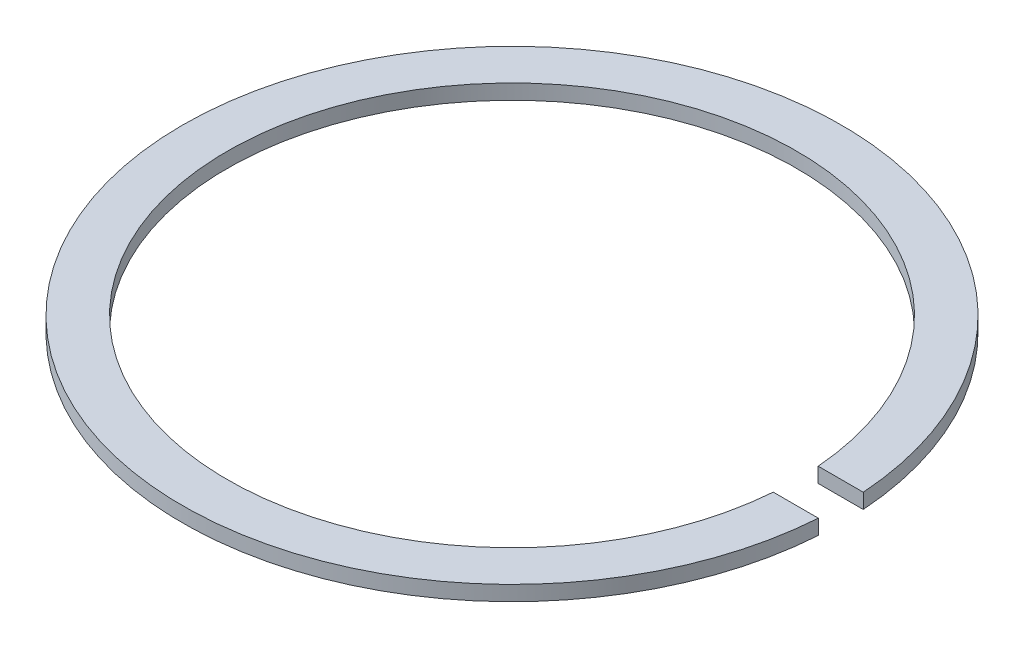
ISO-10303-21;
HEADER;
FILE_DESCRIPTION(('STEP AP214'),'2;1');
FILE_NAME('part.step','',(''),(''),'','','');
FILE_SCHEMA(('AUTOMOTIVE_DESIGN { 1 0 10303 214 1 1 1 1 }'));
ENDSEC;
DATA;
#1=APPLICATION_CONTEXT('core data for automotive mechanical design processes');
#2=APPLICATION_PROTOCOL_DEFINITION('international standard','automotive_design',2000,#1);
#3=PRODUCT_CONTEXT('',#1,'mechanical');
#4=PRODUCT('Part','Part','',(#3));
#5=PRODUCT_RELATED_PRODUCT_CATEGORY('part','',(#4));
#6=PRODUCT_DEFINITION_FORMATION('','',#4);
#7=PRODUCT_DEFINITION_CONTEXT('part definition',#1,'design');
#8=PRODUCT_DEFINITION('design','',#6,#7);
#9=PRODUCT_DEFINITION_SHAPE('','',#8);
#10=(LENGTH_UNIT() NAMED_UNIT(*) SI_UNIT(.MILLI.,.METRE.));
#11=(NAMED_UNIT(*) PLANE_ANGLE_UNIT() SI_UNIT($,.RADIAN.));
#12=(NAMED_UNIT(*) SI_UNIT($,.STERADIAN.) SOLID_ANGLE_UNIT());
#13=UNCERTAINTY_MEASURE_WITH_UNIT(LENGTH_MEASURE(1.E-05),#10,'distance_accuracy_value','');
#14=(GEOMETRIC_REPRESENTATION_CONTEXT(3) GLOBAL_UNCERTAINTY_ASSIGNED_CONTEXT((#13)) GLOBAL_UNIT_ASSIGNED_CONTEXT((#10,
#11,#12)) REPRESENTATION_CONTEXT('',''));
#15=CARTESIAN_POINT('',(0.,0.,0.));
#16=DIRECTION('',(0.,0.,1.));
#17=DIRECTION('',(1.,0.,0.));
#18=AXIS2_PLACEMENT_3D('',#15,#16,#17);
#19=CARTESIAN_POINT('',(0.,-3.,0.));
#20=DIRECTION('',(0.,-1.,0.));
#21=DIRECTION('',(0.,0.,-1.));
#22=AXIS2_PLACEMENT_3D('',#19,#20,#21);
#23=CYLINDRICAL_SURFACE('',#22,22.);
#24=DIRECTION('',(0.,-1.,0.));
#25=VECTOR('',#24,1.);
#26=CARTESIAN_POINT('',(21.948804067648,-3.,-1.5));
#27=LINE('',#26,#25);
#28=CARTESIAN_POINT('',(21.948804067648,2.99999999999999,-1.5));
#29=VERTEX_POINT('',#28);
#30=CARTESIAN_POINT('',(21.948804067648,4.,-1.5));
#31=VERTEX_POINT('',#30);
#32=EDGE_CURVE('E372',#29,#31,#27,.F.);
#33=ORIENTED_EDGE('',*,*,#32,.F.);
#34=CARTESIAN_POINT('',(0.,2.99999999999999,0.));
#35=DIRECTION('',(0.,-1.,0.));
#36=DIRECTION('',(0.,0.,-1.));
#37=AXIS2_PLACEMENT_3D('',#34,#35,#36);
#38=CIRCLE('',#37,22.);
#39=CARTESIAN_POINT('',(21.948804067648,2.99999999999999,1.5));
#40=VERTEX_POINT('',#39);
#41=EDGE_CURVE('E411',#40,#29,#38,.T.);
#42=ORIENTED_EDGE('',*,*,#41,.F.);
#43=DIRECTION('',(0.,-1.,0.));
#44=VECTOR('',#43,1.);
#45=CARTESIAN_POINT('',(21.948804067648,-3.,1.5));
#46=LINE('',#45,#44);
#47=CARTESIAN_POINT('',(21.948804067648,4.,1.5));
#48=VERTEX_POINT('',#47);
#49=EDGE_CURVE('E396',#48,#40,#46,.T.);
#50=ORIENTED_EDGE('',*,*,#49,.F.);
#51=CARTESIAN_POINT('',(0.,4.,0.));
#52=DIRECTION('',(0.,-1.,0.));
#53=DIRECTION('',(0.,0.,-1.));
#54=AXIS2_PLACEMENT_3D('',#51,#52,#53);
#55=CIRCLE('',#54,22.);
#56=EDGE_CURVE('E422',#48,#31,#55,.T.);
#57=ORIENTED_EDGE('',*,*,#56,.T.);
#58=EDGE_LOOP('',(#33,#42,#50,#57));
#59=FACE_BOUND('',#58,.T.);
#60=ADVANCED_FACE('F359',(#59),#23,.T.);
#61=CARTESIAN_POINT('',(22.,2.99999999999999,0.));
#62=DIRECTION('',(0.,-1.,0.));
#63=DIRECTION('',(0.,0.,-1.));
#64=AXIS2_PLACEMENT_3D('',#61,#62,#63);
#65=PLANE('',#64);
#66=DIRECTION('',(1.,0.,0.));
#67=VECTOR('',#66,1.);
#68=CARTESIAN_POINT('',(22.,2.99999999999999,-1.5));
#69=LINE('',#68,#67);
#70=CARTESIAN_POINT('',(18.9406969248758,2.99999999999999,-1.5));
#71=VERTEX_POINT('',#70);
#72=EDGE_CURVE('E414',#71,#29,#69,.T.);
#73=ORIENTED_EDGE('',*,*,#72,.F.);
#74=CARTESIAN_POINT('',(0.,2.99999999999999,0.));
#75=DIRECTION('',(0.,-1.,0.));
#76=DIRECTION('',(0.,0.,-1.));
#77=AXIS2_PLACEMENT_3D('',#74,#75,#76);
#78=CIRCLE('',#77,19.);
#79=CARTESIAN_POINT('',(18.9406969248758,2.99999999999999,1.5));
#80=VERTEX_POINT('',#79);
#81=EDGE_CURVE('E413',#80,#71,#78,.T.);
#82=ORIENTED_EDGE('',*,*,#81,.F.);
#83=DIRECTION('',(-1.,0.,0.));
#84=VECTOR('',#83,1.);
#85=CARTESIAN_POINT('',(22.,2.99999999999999,1.5));
#86=LINE('',#85,#84);
#87=EDGE_CURVE('E399',#40,#80,#86,.T.);
#88=ORIENTED_EDGE('',*,*,#87,.F.);
#89=ORIENTED_EDGE('',*,*,#41,.T.);
#90=EDGE_LOOP('',(#73,#82,#88,#89));
#91=FACE_BOUND('',#90,.T.);
#92=ADVANCED_FACE('F410',(#91),#65,.T.);
#93=CARTESIAN_POINT('',(0.,-3.,0.));
#94=DIRECTION('',(0.,-1.,0.));
#95=DIRECTION('',(0.,0.,-1.));
#96=AXIS2_PLACEMENT_3D('',#93,#94,#95);
#97=CYLINDRICAL_SURFACE('',#96,19.);
#98=DIRECTION('',(0.,-1.,0.));
#99=VECTOR('',#98,1.);
#100=CARTESIAN_POINT('',(18.9406969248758,-3.,-1.5));
#101=LINE('',#100,#99);
#102=CARTESIAN_POINT('',(18.9406969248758,4.,-1.5));
#103=VERTEX_POINT('',#102);
#104=EDGE_CURVE('E404',#103,#71,#101,.T.);
#105=ORIENTED_EDGE('',*,*,#104,.F.);
#106=CARTESIAN_POINT('',(0.,3.99999999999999,0.));
#107=DIRECTION('',(0.,-1.,0.));
#108=DIRECTION('',(0.,0.,-1.));
#109=AXIS2_PLACEMENT_3D('',#106,#107,#108);
#110=CIRCLE('',#109,19.);
#111=CARTESIAN_POINT('',(18.9406969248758,3.99999999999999,1.5));
#112=VERTEX_POINT('',#111);
#113=EDGE_CURVE('E417',#112,#103,#110,.T.);
#114=ORIENTED_EDGE('',*,*,#113,.F.);
#115=DIRECTION('',(0.,-1.,0.));
#116=VECTOR('',#115,1.);
#117=CARTESIAN_POINT('',(18.9406969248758,-3.,1.5));
#118=LINE('',#117,#116);
#119=EDGE_CURVE('E380',#80,#112,#118,.F.);
#120=ORIENTED_EDGE('',*,*,#119,.F.);
#121=ORIENTED_EDGE('',*,*,#81,.T.);
#122=EDGE_LOOP('',(#105,#114,#120,#121));
#123=FACE_BOUND('',#122,.T.);
#124=ADVANCED_FACE('F430',(#123),#97,.F.);
#125=CARTESIAN_POINT('',(22.,3.99999999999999,0.));
#126=DIRECTION('',(0.,1.,0.));
#127=DIRECTION('',(0.,0.,1.));
#128=AXIS2_PLACEMENT_3D('',#125,#126,#127);
#129=PLANE('',#128);
#130=DIRECTION('',(-1.,0.,0.));
#131=VECTOR('',#130,1.);
#132=CARTESIAN_POINT('',(22.,3.99999999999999,-1.5));
#133=LINE('',#132,#131);
#134=EDGE_CURVE('E11',#31,#103,#133,.T.);
#135=ORIENTED_EDGE('',*,*,#134,.F.);
#136=ORIENTED_EDGE('',*,*,#56,.F.);
#137=DIRECTION('',(1.,0.,0.));
#138=VECTOR('',#137,1.);
#139=CARTESIAN_POINT('',(22.,3.99999999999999,1.5));
#140=LINE('',#139,#138);
#141=EDGE_CURVE('E366',#112,#48,#140,.T.);
#142=ORIENTED_EDGE('',*,*,#141,.F.);
#143=ORIENTED_EDGE('',*,*,#113,.T.);
#144=EDGE_LOOP('',(#135,#136,#142,#143));
#145=FACE_BOUND('',#144,.T.);
#146=ADVANCED_FACE('F433',(#145),#129,.T.);
#147=CARTESIAN_POINT('',(22.,4.,1.5));
#148=DIRECTION('',(0.,0.,1.));
#149=DIRECTION('',(1.,0.,0.));
#150=AXIS2_PLACEMENT_3D('',#147,#148,#149);
#151=PLANE('',#150);
#152=ORIENTED_EDGE('',*,*,#49,.T.);
#153=ORIENTED_EDGE('',*,*,#87,.T.);
#154=ORIENTED_EDGE('',*,*,#119,.T.);
#155=ORIENTED_EDGE('',*,*,#141,.T.);
#156=EDGE_LOOP('',(#152,#153,#154,#155));
#157=FACE_BOUND('',#156,.T.);
#158=ADVANCED_FACE('F398',(#157),#151,.F.);
#159=CARTESIAN_POINT('',(22.,4.,-1.5));
#160=DIRECTION('',(0.,0.,-1.));
#161=DIRECTION('',(-1.,0.,0.));
#162=AXIS2_PLACEMENT_3D('',#159,#160,#161);
#163=PLANE('',#162);
#164=ORIENTED_EDGE('',*,*,#32,.T.);
#165=ORIENTED_EDGE('',*,*,#134,.T.);
#166=ORIENTED_EDGE('',*,*,#104,.T.);
#167=ORIENTED_EDGE('',*,*,#72,.T.);
#168=EDGE_LOOP('',(#164,#165,#166,#167));
#169=FACE_BOUND('',#168,.T.);
#170=ADVANCED_FACE('F427',(#169),#163,.F.);
#171=CLOSED_SHELL('',(#60,#92,#124,#146,#158,#170));
#172=MANIFOLD_SOLID_BREP('B2',#171);
#173=ADVANCED_BREP_SHAPE_REPRESENTATION('',(#18,#172),#14);
#174=SHAPE_DEFINITION_REPRESENTATION(#9,#173);
ENDSEC;
END-ISO-10303-21;
